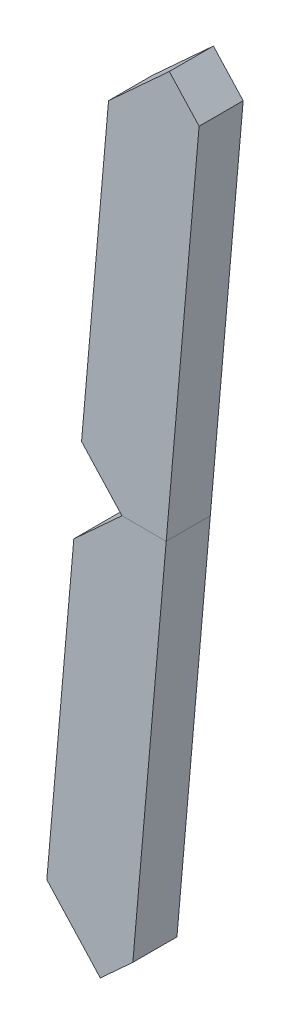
ISO-10303-21;
HEADER;
FILE_DESCRIPTION(('STEP AP214'),'2;1');
FILE_NAME('part.step','',(''),(''),'','','');
FILE_SCHEMA(('AUTOMOTIVE_DESIGN { 1 0 10303 214 1 1 1 1 }'));
ENDSEC;
DATA;
#1=APPLICATION_CONTEXT('core data for automotive mechanical design processes');
#2=APPLICATION_PROTOCOL_DEFINITION('international standard','automotive_design',2000,#1);
#3=PRODUCT_CONTEXT('',#1,'mechanical');
#4=PRODUCT('Part','Part','',(#3));
#5=PRODUCT_RELATED_PRODUCT_CATEGORY('part','',(#4));
#6=PRODUCT_DEFINITION_FORMATION('','',#4);
#7=PRODUCT_DEFINITION_CONTEXT('part definition',#1,'design');
#8=PRODUCT_DEFINITION('design','',#6,#7);
#9=PRODUCT_DEFINITION_SHAPE('','',#8);
#10=(LENGTH_UNIT() NAMED_UNIT(*) SI_UNIT(.MILLI.,.METRE.));
#11=(NAMED_UNIT(*) PLANE_ANGLE_UNIT() SI_UNIT($,.RADIAN.));
#12=(NAMED_UNIT(*) SI_UNIT($,.STERADIAN.) SOLID_ANGLE_UNIT());
#13=UNCERTAINTY_MEASURE_WITH_UNIT(LENGTH_MEASURE(1.E-05),#10,'distance_accuracy_value','');
#14=(GEOMETRIC_REPRESENTATION_CONTEXT(3) GLOBAL_UNCERTAINTY_ASSIGNED_CONTEXT((#13)) GLOBAL_UNIT_ASSIGNED_CONTEXT((#10,
#11,#12)) REPRESENTATION_CONTEXT('',''));
#15=CARTESIAN_POINT('',(0.,0.,0.));
#16=DIRECTION('',(0.,0.,1.));
#17=DIRECTION('',(1.,0.,0.));
#18=AXIS2_PLACEMENT_3D('',#15,#16,#17);
#19=CARTESIAN_POINT('',(2.78896464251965,4.63136133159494,0.));
#20=DIRECTION('',(-0.737277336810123,-0.675590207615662,0.));
#21=DIRECTION('',(0.675590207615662,-0.737277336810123,0.));
#22=AXIS2_PLACEMENT_3D('',#19,#20,#21);
#23=PLANE('',#22);
#24=DIRECTION('',(-0.675590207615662,0.737277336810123,0.));
#25=VECTOR('',#24,1.);
#26=CARTESIAN_POINT('',(2.78896464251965,4.63136133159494,-0.5));
#27=LINE('',#26,#25);
#28=CARTESIAN_POINT('',(3.12675974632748,4.26272266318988,-0.5));
#29=VERTEX_POINT('',#28);
#30=CARTESIAN_POINT('',(2.78896464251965,4.63136133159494,-0.5));
#31=VERTEX_POINT('',#30);
#32=EDGE_CURVE('E126',#29,#31,#27,.T.);
#33=ORIENTED_EDGE('',*,*,#32,.T.);
#34=DIRECTION('',(0.,0.,-1.));
#35=VECTOR('',#34,1.);
#36=CARTESIAN_POINT('',(2.78896464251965,4.63136133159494,0.));
#37=LINE('',#36,#35);
#38=CARTESIAN_POINT('',(2.78896464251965,4.63136133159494,0.));
#39=VERTEX_POINT('',#38);
#40=EDGE_CURVE('E12',#39,#31,#37,.T.);
#41=ORIENTED_EDGE('',*,*,#40,.F.);
#42=DIRECTION('',(-0.675590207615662,0.737277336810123,0.));
#43=VECTOR('',#42,1.);
#44=CARTESIAN_POINT('',(2.78896464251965,4.63136133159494,0.));
#45=LINE('',#44,#43);
#46=CARTESIAN_POINT('',(3.12675974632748,4.26272266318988,0.));
#47=VERTEX_POINT('',#46);
#48=EDGE_CURVE('E136',#47,#39,#45,.T.);
#49=ORIENTED_EDGE('',*,*,#48,.F.);
#50=DIRECTION('',(0.,0.,-1.));
#51=VECTOR('',#50,1.);
#52=CARTESIAN_POINT('',(3.12675974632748,4.26272266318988,0.));
#53=LINE('',#52,#51);
#54=EDGE_CURVE('E122',#47,#29,#53,.T.);
#55=ORIENTED_EDGE('',*,*,#54,.T.);
#56=EDGE_LOOP('',(#33,#41,#49,#55));
#57=FACE_BOUND('',#56,.T.);
#58=ADVANCED_FACE('F42',(#57),#23,.F.);
#59=CARTESIAN_POINT('',(2.09995465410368,4.,0.));
#60=DIRECTION('',(0.675590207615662,-0.737277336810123,0.));
#61=DIRECTION('',(0.737277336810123,0.675590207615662,0.));
#62=AXIS2_PLACEMENT_3D('',#59,#60,#61);
#63=PLANE('',#62);
#64=DIRECTION('',(-0.737277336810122,-0.675590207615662,0.));
#65=VECTOR('',#64,1.);
#66=CARTESIAN_POINT('',(2.09995465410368,4.,-0.5));
#67=LINE('',#66,#65);
#68=CARTESIAN_POINT('',(2.09995465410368,4.,-0.5));
#69=VERTEX_POINT('',#68);
#70=EDGE_CURVE('E129',#31,#69,#67,.T.);
#71=ORIENTED_EDGE('',*,*,#70,.T.);
#72=DIRECTION('',(0.,0.,-1.));
#73=VECTOR('',#72,1.);
#74=CARTESIAN_POINT('',(2.09995465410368,4.,0.));
#75=LINE('',#74,#73);
#76=CARTESIAN_POINT('',(2.09995465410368,4.,0.));
#77=VERTEX_POINT('',#76);
#78=EDGE_CURVE('E50',#77,#69,#75,.T.);
#79=ORIENTED_EDGE('',*,*,#78,.F.);
#80=DIRECTION('',(-0.737277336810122,-0.675590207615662,0.));
#81=VECTOR('',#80,1.);
#82=CARTESIAN_POINT('',(2.09995465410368,4.,0.));
#83=LINE('',#82,#81);
#84=EDGE_CURVE('E95',#39,#77,#83,.T.);
#85=ORIENTED_EDGE('',*,*,#84,.F.);
#86=ORIENTED_EDGE('',*,*,#40,.T.);
#87=EDGE_LOOP('',(#71,#79,#85,#86));
#88=FACE_BOUND('',#87,.T.);
#89=ADVANCED_FACE('F160',(#88),#63,.F.);
#90=CARTESIAN_POINT('',(1.79374433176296,0.499999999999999,0.));
#91=DIRECTION('',(0.996194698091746,-0.0871557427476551,0.));
#92=DIRECTION('',(0.0871557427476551,0.996194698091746,0.));
#93=AXIS2_PLACEMENT_3D('',#90,#91,#92);
#94=PLANE('',#93);
#95=DIRECTION('',(-0.0871557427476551,-0.996194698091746,0.));
#96=VECTOR('',#95,1.);
#97=CARTESIAN_POINT('',(1.79374433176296,0.499999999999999,-0.5));
#98=LINE('',#97,#96);
#99=CARTESIAN_POINT('',(1.79374433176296,0.499999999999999,-0.5));
#100=VERTEX_POINT('',#99);
#101=EDGE_CURVE('E131',#69,#100,#98,.T.);
#102=ORIENTED_EDGE('',*,*,#101,.T.);
#103=DIRECTION('',(0.,0.,-1.));
#104=VECTOR('',#103,1.);
#105=CARTESIAN_POINT('',(1.79374433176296,0.499999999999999,0.));
#106=LINE('',#105,#104);
#107=CARTESIAN_POINT('',(1.79374433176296,0.499999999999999,0.));
#108=VERTEX_POINT('',#107);
#109=EDGE_CURVE('E117',#108,#100,#106,.T.);
#110=ORIENTED_EDGE('',*,*,#109,.F.);
#111=DIRECTION('',(-0.0871557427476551,-0.996194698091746,0.));
#112=VECTOR('',#111,1.);
#113=CARTESIAN_POINT('',(1.79374433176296,0.499999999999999,0.));
#114=LINE('',#113,#112);
#115=EDGE_CURVE('E108',#77,#108,#114,.T.);
#116=ORIENTED_EDGE('',*,*,#115,.F.);
#117=ORIENTED_EDGE('',*,*,#78,.T.);
#118=EDGE_LOOP('',(#102,#110,#116,#117));
#119=FACE_BOUND('',#118,.T.);
#120=ADVANCED_FACE('F142',(#119),#94,.F.);
#121=CARTESIAN_POINT('',(2.25190991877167,0.,0.));
#122=DIRECTION('',(0.737277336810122,0.675590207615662,0.));
#123=DIRECTION('',(-0.675590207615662,0.737277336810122,0.));
#124=AXIS2_PLACEMENT_3D('',#121,#122,#123);
#125=PLANE('',#124);
#126=DIRECTION('',(0.675590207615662,-0.737277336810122,0.));
#127=VECTOR('',#126,1.);
#128=CARTESIAN_POINT('',(2.25190991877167,0.,-0.5));
#129=LINE('',#128,#127);
#130=CARTESIAN_POINT('',(2.25190991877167,0.,-0.5));
#131=VERTEX_POINT('',#130);
#132=EDGE_CURVE('E116',#100,#131,#129,.T.);
#133=ORIENTED_EDGE('',*,*,#132,.T.);
#134=DIRECTION('',(0.,0.,-1.));
#135=VECTOR('',#134,1.);
#136=CARTESIAN_POINT('',(2.25190991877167,0.,0.));
#137=LINE('',#136,#135);
#138=CARTESIAN_POINT('',(2.25190991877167,0.,0.));
#139=VERTEX_POINT('',#138);
#140=EDGE_CURVE('E113',#139,#131,#137,.T.);
#141=ORIENTED_EDGE('',*,*,#140,.F.);
#142=DIRECTION('',(0.675590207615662,-0.737277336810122,0.));
#143=VECTOR('',#142,1.);
#144=CARTESIAN_POINT('',(2.25190991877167,0.,0.));
#145=LINE('',#144,#143);
#146=EDGE_CURVE('E102',#108,#139,#145,.T.);
#147=ORIENTED_EDGE('',*,*,#146,.F.);
#148=ORIENTED_EDGE('',*,*,#109,.T.);
#149=EDGE_LOOP('',(#133,#141,#147,#148));
#150=FACE_BOUND('',#149,.T.);
#151=ADVANCED_FACE('F114',(#150),#125,.F.);
#152=CARTESIAN_POINT('',(2.75381983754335,0.,0.));
#153=DIRECTION('',(0.,1.,0.));
#154=DIRECTION('',(-1.,0.,0.));
#155=AXIS2_PLACEMENT_3D('',#152,#153,#154);
#156=PLANE('',#155);
#157=DIRECTION('',(1.,0.,0.));
#158=VECTOR('',#157,1.);
#159=CARTESIAN_POINT('',(2.75381983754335,0.,-0.5));
#160=LINE('',#159,#158);
#161=CARTESIAN_POINT('',(2.75381983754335,0.,-0.5));
#162=VERTEX_POINT('',#161);
#163=EDGE_CURVE('E81',#131,#162,#160,.T.);
#164=ORIENTED_EDGE('',*,*,#163,.T.);
#165=DIRECTION('',(0.,0.,-1.));
#166=VECTOR('',#165,1.);
#167=CARTESIAN_POINT('',(2.75381983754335,0.,0.));
#168=LINE('',#167,#166);
#169=CARTESIAN_POINT('',(2.75381983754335,0.,0.));
#170=VERTEX_POINT('',#169);
#171=EDGE_CURVE('E118',#170,#162,#168,.T.);
#172=ORIENTED_EDGE('',*,*,#171,.F.);
#173=DIRECTION('',(1.,0.,0.));
#174=VECTOR('',#173,1.);
#175=CARTESIAN_POINT('',(2.75381983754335,0.,0.));
#176=LINE('',#175,#174);
#177=EDGE_CURVE('E106',#139,#170,#176,.T.);
#178=ORIENTED_EDGE('',*,*,#177,.F.);
#179=ORIENTED_EDGE('',*,*,#140,.T.);
#180=EDGE_LOOP('',(#164,#172,#178,#179));
#181=FACE_BOUND('',#180,.T.);
#182=ADVANCED_FACE('F120',(#181),#156,.F.);
#183=CARTESIAN_POINT('',(3.12675974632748,4.26272266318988,0.));
#184=DIRECTION('',(-0.996194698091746,0.0871557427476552,0.));
#185=DIRECTION('',(-0.0871557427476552,-0.996194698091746,0.));
#186=AXIS2_PLACEMENT_3D('',#183,#184,#185);
#187=PLANE('',#186);
#188=DIRECTION('',(0.0871557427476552,0.996194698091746,0.));
#189=VECTOR('',#188,1.);
#190=CARTESIAN_POINT('',(3.12675974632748,4.26272266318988,-0.5));
#191=LINE('',#190,#189);
#192=EDGE_CURVE('E87',#162,#29,#191,.T.);
#193=ORIENTED_EDGE('',*,*,#192,.T.);
#194=ORIENTED_EDGE('',*,*,#54,.F.);
#195=DIRECTION('',(0.0871557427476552,0.996194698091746,0.));
#196=VECTOR('',#195,1.);
#197=CARTESIAN_POINT('',(3.12675974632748,4.26272266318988,0.));
#198=LINE('',#197,#196);
#199=EDGE_CURVE('E58',#170,#47,#198,.T.);
#200=ORIENTED_EDGE('',*,*,#199,.F.);
#201=ORIENTED_EDGE('',*,*,#171,.T.);
#202=EDGE_LOOP('',(#193,#194,#200,#201));
#203=FACE_BOUND('',#202,.T.);
#204=ADVANCED_FACE('F149',(#203),#187,.F.);
#205=CARTESIAN_POINT('',(0.,0.,0.));
#206=DIRECTION('',(0.,0.,1.));
#207=DIRECTION('',(-1.,0.,0.));
#208=AXIS2_PLACEMENT_3D('',#205,#206,#207);
#209=PLANE('',#208);
#210=ORIENTED_EDGE('',*,*,#48,.T.);
#211=ORIENTED_EDGE('',*,*,#84,.T.);
#212=ORIENTED_EDGE('',*,*,#115,.T.);
#213=ORIENTED_EDGE('',*,*,#146,.T.);
#214=ORIENTED_EDGE('',*,*,#177,.T.);
#215=ORIENTED_EDGE('',*,*,#199,.T.);
#216=EDGE_LOOP('',(#210,#211,#212,#213,#214,#215));
#217=FACE_BOUND('',#216,.T.);
#218=ADVANCED_FACE('F104',(#217),#209,.T.);
#219=CARTESIAN_POINT('',(0.,0.,-0.5));
#220=DIRECTION('',(0.,0.,1.));
#221=DIRECTION('',(-1.,0.,0.));
#222=AXIS2_PLACEMENT_3D('',#219,#220,#221);
#223=PLANE('',#222);
#224=ORIENTED_EDGE('',*,*,#32,.F.);
#225=ORIENTED_EDGE('',*,*,#192,.F.);
#226=ORIENTED_EDGE('',*,*,#163,.F.);
#227=ORIENTED_EDGE('',*,*,#132,.F.);
#228=ORIENTED_EDGE('',*,*,#101,.F.);
#229=ORIENTED_EDGE('',*,*,#70,.F.);
#230=EDGE_LOOP('',(#224,#225,#226,#227,#228,#229));
#231=FACE_BOUND('',#230,.T.);
#232=ADVANCED_FACE('F145',(#231),#223,.F.);
#233=CLOSED_SHELL('',(#58,#89,#120,#151,#182,#204,#218,#232));
#234=MANIFOLD_SOLID_BREP('B2',#233);
#235=CARTESIAN_POINT('',(2.00684433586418,-4.66220489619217,0.));
#236=DIRECTION('',(0.737277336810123,0.675590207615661,0.));
#237=DIRECTION('',(-0.675590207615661,0.737277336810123,0.));
#238=AXIS2_PLACEMENT_3D('',#235,#236,#237);
#239=PLANE('',#238);
#240=DIRECTION('',(0.675590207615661,-0.737277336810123,0.));
#241=VECTOR('',#240,1.);
#242=CARTESIAN_POINT('',(2.00684433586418,-4.66220489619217,-0.5));
#243=LINE('',#242,#241);
#244=CARTESIAN_POINT('',(1.40004534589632,-4.,-0.5));
#245=VERTEX_POINT('',#244);
#246=CARTESIAN_POINT('',(2.00684433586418,-4.66220489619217,-0.5));
#247=VERTEX_POINT('',#246);
#248=EDGE_CURVE('E301',#245,#247,#243,.T.);
#249=ORIENTED_EDGE('',*,*,#248,.T.);
#250=DIRECTION('',(0.,0.,-1.));
#251=VECTOR('',#250,1.);
#252=CARTESIAN_POINT('',(2.00684433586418,-4.66220489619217,0.));
#253=LINE('',#252,#251);
#254=CARTESIAN_POINT('',(2.00684433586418,-4.66220489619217,0.));
#255=VERTEX_POINT('',#254);
#256=EDGE_CURVE('E40',#255,#247,#253,.T.);
#257=ORIENTED_EDGE('',*,*,#256,.F.);
#258=DIRECTION('',(0.675590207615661,-0.737277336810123,0.));
#259=VECTOR('',#258,1.);
#260=CARTESIAN_POINT('',(2.00684433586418,-4.66220489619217,0.));
#261=LINE('',#260,#259);
#262=CARTESIAN_POINT('',(1.40004534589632,-4.,0.));
#263=VERTEX_POINT('',#262);
#264=EDGE_CURVE('E311',#263,#255,#261,.T.);
#265=ORIENTED_EDGE('',*,*,#264,.F.);
#266=DIRECTION('',(0.,0.,-1.));
#267=VECTOR('',#266,1.);
#268=CARTESIAN_POINT('',(1.40004534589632,-4.,0.));
#269=LINE('',#268,#267);
#270=EDGE_CURVE('E297',#263,#245,#269,.T.);
#271=ORIENTED_EDGE('',*,*,#270,.T.);
#272=EDGE_LOOP('',(#249,#257,#265,#271));
#273=FACE_BOUND('',#272,.T.);
#274=ADVANCED_FACE('F217',(#273),#239,.F.);
#275=CARTESIAN_POINT('',(2.37548300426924,-4.32440979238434,0.));
#276=DIRECTION('',(-0.675590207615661,0.737277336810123,0.));
#277=DIRECTION('',(-0.737277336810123,-0.675590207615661,0.));
#278=AXIS2_PLACEMENT_3D('',#275,#276,#277);
#279=PLANE('',#278);
#280=DIRECTION('',(0.737277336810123,0.675590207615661,0.));
#281=VECTOR('',#280,1.);
#282=CARTESIAN_POINT('',(2.37548300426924,-4.32440979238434,-0.5));
#283=LINE('',#282,#281);
#284=CARTESIAN_POINT('',(2.37548300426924,-4.32440979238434,-0.5));
#285=VERTEX_POINT('',#284);
#286=EDGE_CURVE('E304',#247,#285,#283,.T.);
#287=ORIENTED_EDGE('',*,*,#286,.T.);
#288=DIRECTION('',(0.,0.,-1.));
#289=VECTOR('',#288,1.);
#290=CARTESIAN_POINT('',(2.37548300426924,-4.32440979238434,0.));
#291=LINE('',#290,#289);
#292=CARTESIAN_POINT('',(2.37548300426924,-4.32440979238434,0.));
#293=VERTEX_POINT('',#292);
#294=EDGE_CURVE('E225',#293,#285,#291,.T.);
#295=ORIENTED_EDGE('',*,*,#294,.F.);
#296=DIRECTION('',(0.737277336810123,0.675590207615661,0.));
#297=VECTOR('',#296,1.);
#298=CARTESIAN_POINT('',(2.37548300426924,-4.32440979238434,0.));
#299=LINE('',#298,#297);
#300=EDGE_CURVE('E270',#255,#293,#299,.T.);
#301=ORIENTED_EDGE('',*,*,#300,.F.);
#302=ORIENTED_EDGE('',*,*,#256,.T.);
#303=EDGE_LOOP('',(#287,#295,#301,#302));
#304=FACE_BOUND('',#303,.T.);
#305=ADVANCED_FACE('F335',(#304),#279,.F.);
#306=CARTESIAN_POINT('',(2.75381983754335,0.,0.));
#307=DIRECTION('',(-0.996194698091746,0.087155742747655,0.));
#308=DIRECTION('',(-0.087155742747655,-0.996194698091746,0.));
#309=AXIS2_PLACEMENT_3D('',#306,#307,#308);
#310=PLANE('',#309);
#311=DIRECTION('',(0.087155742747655,0.996194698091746,0.));
#312=VECTOR('',#311,1.);
#313=CARTESIAN_POINT('',(2.75381983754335,0.,-0.5));
#314=LINE('',#313,#312);
#315=CARTESIAN_POINT('',(2.75381983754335,0.,-0.5));
#316=VERTEX_POINT('',#315);
#317=EDGE_CURVE('E306',#285,#316,#314,.T.);
#318=ORIENTED_EDGE('',*,*,#317,.T.);
#319=DIRECTION('',(0.,0.,-1.));
#320=VECTOR('',#319,1.);
#321=CARTESIAN_POINT('',(2.75381983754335,0.,0.));
#322=LINE('',#321,#320);
#323=CARTESIAN_POINT('',(2.75381983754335,0.,0.));
#324=VERTEX_POINT('',#323);
#325=EDGE_CURVE('E292',#324,#316,#322,.T.);
#326=ORIENTED_EDGE('',*,*,#325,.F.);
#327=DIRECTION('',(0.087155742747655,0.996194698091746,0.));
#328=VECTOR('',#327,1.);
#329=CARTESIAN_POINT('',(2.75381983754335,0.,0.));
#330=LINE('',#329,#328);
#331=EDGE_CURVE('E283',#293,#324,#330,.T.);
#332=ORIENTED_EDGE('',*,*,#331,.F.);
#333=ORIENTED_EDGE('',*,*,#294,.T.);
#334=EDGE_LOOP('',(#318,#326,#332,#333));
#335=FACE_BOUND('',#334,.T.);
#336=ADVANCED_FACE('F317',(#335),#310,.F.);
#337=CARTESIAN_POINT('',(2.25190991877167,0.,0.));
#338=DIRECTION('',(0.,-1.,0.));
#339=DIRECTION('',(1.,0.,0.));
#340=AXIS2_PLACEMENT_3D('',#337,#338,#339);
#341=PLANE('',#340);
#342=DIRECTION('',(-1.,0.,0.));
#343=VECTOR('',#342,1.);
#344=CARTESIAN_POINT('',(2.25190991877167,0.,-0.5));
#345=LINE('',#344,#343);
#346=CARTESIAN_POINT('',(2.25190991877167,0.,-0.5));
#347=VERTEX_POINT('',#346);
#348=EDGE_CURVE('E291',#316,#347,#345,.T.);
#349=ORIENTED_EDGE('',*,*,#348,.T.);
#350=DIRECTION('',(0.,0.,-1.));
#351=VECTOR('',#350,1.);
#352=CARTESIAN_POINT('',(2.25190991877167,0.,0.));
#353=LINE('',#352,#351);
#354=CARTESIAN_POINT('',(2.25190991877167,0.,0.));
#355=VERTEX_POINT('',#354);
#356=EDGE_CURVE('E288',#355,#347,#353,.T.);
#357=ORIENTED_EDGE('',*,*,#356,.F.);
#358=DIRECTION('',(-1.,0.,0.));
#359=VECTOR('',#358,1.);
#360=CARTESIAN_POINT('',(2.25190991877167,0.,0.));
#361=LINE('',#360,#359);
#362=EDGE_CURVE('E277',#324,#355,#361,.T.);
#363=ORIENTED_EDGE('',*,*,#362,.F.);
#364=ORIENTED_EDGE('',*,*,#325,.T.);
#365=EDGE_LOOP('',(#349,#357,#363,#364));
#366=FACE_BOUND('',#365,.T.);
#367=ADVANCED_FACE('F289',(#366),#341,.F.);
#368=CARTESIAN_POINT('',(1.70625566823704,-0.499999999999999,0.));
#369=DIRECTION('',(0.675590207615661,-0.737277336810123,0.));
#370=DIRECTION('',(0.737277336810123,0.675590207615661,0.));
#371=AXIS2_PLACEMENT_3D('',#368,#369,#370);
#372=PLANE('',#371);
#373=DIRECTION('',(-0.737277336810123,-0.675590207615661,0.));
#374=VECTOR('',#373,1.);
#375=CARTESIAN_POINT('',(1.70625566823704,-0.499999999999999,-0.5));
#376=LINE('',#375,#374);
#377=CARTESIAN_POINT('',(1.70625566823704,-0.499999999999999,-0.5));
#378=VERTEX_POINT('',#377);
#379=EDGE_CURVE('E256',#347,#378,#376,.T.);
#380=ORIENTED_EDGE('',*,*,#379,.T.);
#381=DIRECTION('',(0.,0.,-1.));
#382=VECTOR('',#381,1.);
#383=CARTESIAN_POINT('',(1.70625566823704,-0.499999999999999,0.));
#384=LINE('',#383,#382);
#385=CARTESIAN_POINT('',(1.70625566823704,-0.499999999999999,0.));
#386=VERTEX_POINT('',#385);
#387=EDGE_CURVE('E293',#386,#378,#384,.T.);
#388=ORIENTED_EDGE('',*,*,#387,.F.);
#389=DIRECTION('',(-0.737277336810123,-0.675590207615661,0.));
#390=VECTOR('',#389,1.);
#391=CARTESIAN_POINT('',(1.70625566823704,-0.499999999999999,0.));
#392=LINE('',#391,#390);
#393=EDGE_CURVE('E281',#355,#386,#392,.T.);
#394=ORIENTED_EDGE('',*,*,#393,.F.);
#395=ORIENTED_EDGE('',*,*,#356,.T.);
#396=EDGE_LOOP('',(#380,#388,#394,#395));
#397=FACE_BOUND('',#396,.T.);
#398=ADVANCED_FACE('F295',(#397),#372,.F.);
#399=CARTESIAN_POINT('',(1.40004534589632,-4.,0.));
#400=DIRECTION('',(0.996194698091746,-0.0871557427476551,0.));
#401=DIRECTION('',(0.0871557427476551,0.996194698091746,0.));
#402=AXIS2_PLACEMENT_3D('',#399,#400,#401);
#403=PLANE('',#402);
#404=DIRECTION('',(-0.0871557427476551,-0.996194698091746,0.));
#405=VECTOR('',#404,1.);
#406=CARTESIAN_POINT('',(1.40004534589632,-4.,-0.5));
#407=LINE('',#406,#405);
#408=EDGE_CURVE('E262',#378,#245,#407,.T.);
#409=ORIENTED_EDGE('',*,*,#408,.T.);
#410=ORIENTED_EDGE('',*,*,#270,.F.);
#411=DIRECTION('',(-0.0871557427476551,-0.996194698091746,0.));
#412=VECTOR('',#411,1.);
#413=CARTESIAN_POINT('',(1.40004534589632,-4.,0.));
#414=LINE('',#413,#412);
#415=EDGE_CURVE('E233',#386,#263,#414,.T.);
#416=ORIENTED_EDGE('',*,*,#415,.F.);
#417=ORIENTED_EDGE('',*,*,#387,.T.);
#418=EDGE_LOOP('',(#409,#410,#416,#417));
#419=FACE_BOUND('',#418,.T.);
#420=ADVANCED_FACE('F324',(#419),#403,.F.);
#421=CARTESIAN_POINT('',(0.,0.,0.));
#422=DIRECTION('',(0.,0.,-1.));
#423=DIRECTION('',(-1.,0.,0.));
#424=AXIS2_PLACEMENT_3D('',#421,#422,#423);
#425=PLANE('',#424);
#426=ORIENTED_EDGE('',*,*,#264,.T.);
#427=ORIENTED_EDGE('',*,*,#300,.T.);
#428=ORIENTED_EDGE('',*,*,#331,.T.);
#429=ORIENTED_EDGE('',*,*,#362,.T.);
#430=ORIENTED_EDGE('',*,*,#393,.T.);
#431=ORIENTED_EDGE('',*,*,#415,.T.);
#432=EDGE_LOOP('',(#426,#427,#428,#429,#430,#431));
#433=FACE_BOUND('',#432,.T.);
#434=ADVANCED_FACE('F279',(#433),#425,.F.);
#435=CARTESIAN_POINT('',(0.,0.,-0.5));
#436=DIRECTION('',(0.,0.,-1.));
#437=DIRECTION('',(-1.,0.,0.));
#438=AXIS2_PLACEMENT_3D('',#435,#436,#437);
#439=PLANE('',#438);
#440=ORIENTED_EDGE('',*,*,#248,.F.);
#441=ORIENTED_EDGE('',*,*,#408,.F.);
#442=ORIENTED_EDGE('',*,*,#379,.F.);
#443=ORIENTED_EDGE('',*,*,#348,.F.);
#444=ORIENTED_EDGE('',*,*,#317,.F.);
#445=ORIENTED_EDGE('',*,*,#286,.F.);
#446=EDGE_LOOP('',(#440,#441,#442,#443,#444,#445));
#447=FACE_BOUND('',#446,.T.);
#448=ADVANCED_FACE('F320',(#447),#439,.T.);
#449=CLOSED_SHELL('',(#274,#305,#336,#367,#398,#420,#434,#448));
#450=MANIFOLD_SOLID_BREP('B6',#449);
#451=ADVANCED_BREP_SHAPE_REPRESENTATION('',(#18,#234,#450),#14);
#452=SHAPE_DEFINITION_REPRESENTATION(#9,#451);
ENDSEC;
END-ISO-10303-21;
